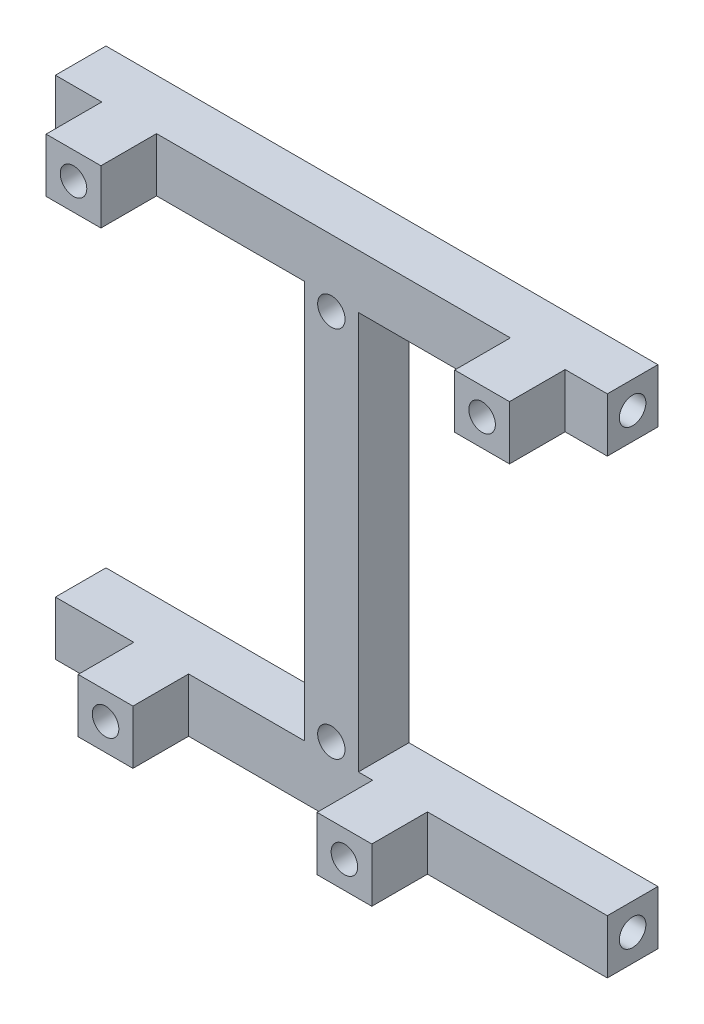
ISO-10303-21;
HEADER;
FILE_DESCRIPTION(('STEP AP214'),'2;1');
FILE_NAME('part.step','',(''),(''),'','','');
FILE_SCHEMA(('AUTOMOTIVE_DESIGN { 1 0 10303 214 1 1 1 1 }'));
ENDSEC;
DATA;
#1=APPLICATION_CONTEXT('core data for automotive mechanical design processes');
#2=APPLICATION_PROTOCOL_DEFINITION('international standard','automotive_design',2000,#1);
#3=PRODUCT_CONTEXT('',#1,'mechanical');
#4=PRODUCT('Part','Part','',(#3));
#5=PRODUCT_RELATED_PRODUCT_CATEGORY('part','',(#4));
#6=PRODUCT_DEFINITION_FORMATION('','',#4);
#7=PRODUCT_DEFINITION_CONTEXT('part definition',#1,'design');
#8=PRODUCT_DEFINITION('design','',#6,#7);
#9=PRODUCT_DEFINITION_SHAPE('','',#8);
#10=(LENGTH_UNIT() NAMED_UNIT(*) SI_UNIT(.MILLI.,.METRE.));
#11=(NAMED_UNIT(*) PLANE_ANGLE_UNIT() SI_UNIT($,.RADIAN.));
#12=(NAMED_UNIT(*) SI_UNIT($,.STERADIAN.) SOLID_ANGLE_UNIT());
#13=UNCERTAINTY_MEASURE_WITH_UNIT(LENGTH_MEASURE(1.E-05),#10,'distance_accuracy_value','');
#14=(GEOMETRIC_REPRESENTATION_CONTEXT(3) GLOBAL_UNCERTAINTY_ASSIGNED_CONTEXT((#13)) GLOBAL_UNIT_ASSIGNED_CONTEXT((#10,
#11,#12)) REPRESENTATION_CONTEXT('',''));
#15=CARTESIAN_POINT('',(0.,0.,0.));
#16=DIRECTION('',(0.,0.,1.));
#17=DIRECTION('',(1.,0.,0.));
#18=AXIS2_PLACEMENT_3D('',#15,#16,#17);
#19=CARTESIAN_POINT('',(0.,0.,6.));
#20=DIRECTION('',(0.,0.,-1.));
#21=DIRECTION('',(-1.,0.,0.));
#22=AXIS2_PLACEMENT_3D('',#19,#20,#21);
#23=PLANE('',#22);
#24=DIRECTION('',(1.,0.,0.));
#25=VECTOR('',#24,1.);
#26=CARTESIAN_POINT('',(-39.73,-30.,6.));
#27=LINE('',#26,#25);
#28=CARTESIAN_POINT('',(11.4,-30.,6.));
#29=VERTEX_POINT('',#28);
#30=CARTESIAN_POINT('',(32.73,-30.,6.));
#31=VERTEX_POINT('',#30);
#32=EDGE_CURVE('E266',#29,#31,#27,.T.);
#33=ORIENTED_EDGE('',*,*,#32,.T.);
#34=DIRECTION('',(0.,-1.,0.));
#35=VECTOR('',#34,1.);
#36=CARTESIAN_POINT('',(32.73,-30.,6.));
#37=LINE('',#36,#35);
#38=CARTESIAN_POINT('',(32.73,-23.6,6.));
#39=VERTEX_POINT('',#38);
#40=EDGE_CURVE('E509',#39,#31,#37,.T.);
#41=ORIENTED_EDGE('',*,*,#40,.F.);
#42=DIRECTION('',(-1.,0.,0.));
#43=VECTOR('',#42,1.);
#44=CARTESIAN_POINT('',(3.20000000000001,-23.6,6.));
#45=LINE('',#44,#43);
#46=CARTESIAN_POINT('',(11.4,-23.6,6.));
#47=VERTEX_POINT('',#46);
#48=EDGE_CURVE('E271',#39,#47,#45,.T.);
#49=ORIENTED_EDGE('',*,*,#48,.T.);
#50=DIRECTION('',(0.,1.,0.));
#51=VECTOR('',#50,1.);
#52=CARTESIAN_POINT('',(11.4,-30.,6.));
#53=LINE('',#52,#51);
#54=EDGE_CURVE('E366',#29,#47,#53,.T.);
#55=ORIENTED_EDGE('',*,*,#54,.F.);
#56=EDGE_LOOP('',(#33,#41,#49,#55));
#57=FACE_BOUND('',#56,.T.);
#58=ADVANCED_FACE('F33',(#57),#23,.F.);
#59=CARTESIAN_POINT('',(0.,22.1,6.));
#60=DIRECTION('',(0.,0.,1.));
#61=DIRECTION('',(1.,0.,0.));
#62=AXIS2_PLACEMENT_3D('',#59,#60,#61);
#63=CIRCLE('',#62,1.625);
#64=CARTESIAN_POINT('',(1.62500000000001,22.1,6.));
#65=VERTEX_POINT('',#64);
#66=EDGE_CURVE('E337',#65,#65,#63,.T.);
#67=ORIENTED_EDGE('',*,*,#66,.F.);
#68=EDGE_LOOP('',(#67));
#69=FACE_BOUND('',#68,.T.);
#70=CARTESIAN_POINT('',(0.,-22.1,6.));
#71=DIRECTION('',(0.,0.,1.));
#72=DIRECTION('',(1.,0.,0.));
#73=AXIS2_PLACEMENT_3D('',#70,#71,#72);
#74=CIRCLE('',#73,1.625);
#75=CARTESIAN_POINT('',(1.62500000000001,-22.1,6.));
#76=VERTEX_POINT('',#75);
#77=EDGE_CURVE('E330',#76,#76,#74,.T.);
#78=ORIENTED_EDGE('',*,*,#77,.F.);
#79=EDGE_LOOP('',(#78));
#80=FACE_BOUND('',#79,.T.);
#81=DIRECTION('',(0.,-1.,0.));
#82=VECTOR('',#81,1.);
#83=CARTESIAN_POINT('',(4.90000000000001,-30.,6.));
#84=LINE('',#83,#82);
#85=CARTESIAN_POINT('',(4.90000000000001,-23.6,6.));
#86=VERTEX_POINT('',#85);
#87=CARTESIAN_POINT('',(4.90000000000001,-30.,6.));
#88=VERTEX_POINT('',#87);
#89=EDGE_CURVE('E373',#86,#88,#84,.T.);
#90=ORIENTED_EDGE('',*,*,#89,.F.);
#91=CARTESIAN_POINT('',(3.20000000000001,-23.6,6.));
#92=VERTEX_POINT('',#91);
#93=EDGE_CURVE('E269',#86,#92,#45,.T.);
#94=ORIENTED_EDGE('',*,*,#93,.T.);
#95=DIRECTION('',(0.,1.,0.));
#96=VECTOR('',#95,1.);
#97=CARTESIAN_POINT('',(3.20000000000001,-23.6,6.));
#98=LINE('',#97,#96);
#99=CARTESIAN_POINT('',(3.20000000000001,23.6,6.));
#100=VERTEX_POINT('',#99);
#101=EDGE_CURVE('E273',#92,#100,#98,.T.);
#102=ORIENTED_EDGE('',*,*,#101,.T.);
#103=DIRECTION('',(1.,0.,0.));
#104=VECTOR('',#103,1.);
#105=CARTESIAN_POINT('',(3.20000000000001,23.6,6.));
#106=LINE('',#105,#104);
#107=CARTESIAN_POINT('',(21.23,23.6,6.));
#108=VERTEX_POINT('',#107);
#109=EDGE_CURVE('E276',#100,#108,#106,.T.);
#110=ORIENTED_EDGE('',*,*,#109,.T.);
#111=DIRECTION('',(0.,-1.,0.));
#112=VECTOR('',#111,1.);
#113=CARTESIAN_POINT('',(21.23,30.,6.));
#114=LINE('',#113,#112);
#115=CARTESIAN_POINT('',(21.23,30.,6.));
#116=VERTEX_POINT('',#115);
#117=EDGE_CURVE('E427',#116,#108,#114,.T.);
#118=ORIENTED_EDGE('',*,*,#117,.F.);
#119=DIRECTION('',(-1.,0.,0.));
#120=VECTOR('',#119,1.);
#121=CARTESIAN_POINT('',(-39.73,30.,6.));
#122=LINE('',#121,#120);
#123=CARTESIAN_POINT('',(-20.73,30.,6.));
#124=VERTEX_POINT('',#123);
#125=EDGE_CURVE('E241',#116,#124,#122,.T.);
#126=ORIENTED_EDGE('',*,*,#125,.T.);
#127=DIRECTION('',(0.,1.,0.));
#128=VECTOR('',#127,1.);
#129=CARTESIAN_POINT('',(-20.73,23.6,6.));
#130=LINE('',#129,#128);
#131=CARTESIAN_POINT('',(-20.73,23.6,6.));
#132=VERTEX_POINT('',#131);
#133=EDGE_CURVE('E448',#132,#124,#130,.T.);
#134=ORIENTED_EDGE('',*,*,#133,.F.);
#135=DIRECTION('',(1.,0.,0.));
#136=VECTOR('',#135,1.);
#137=CARTESIAN_POINT('',(-39.73,23.6,6.));
#138=LINE('',#137,#136);
#139=CARTESIAN_POINT('',(-3.19999999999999,23.6,6.));
#140=VERTEX_POINT('',#139);
#141=EDGE_CURVE('E250',#132,#140,#138,.T.);
#142=ORIENTED_EDGE('',*,*,#141,.T.);
#143=DIRECTION('',(0.,-1.,0.));
#144=VECTOR('',#143,1.);
#145=CARTESIAN_POINT('',(-3.19999999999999,-23.6,6.));
#146=LINE('',#145,#144);
#147=CARTESIAN_POINT('',(-3.19999999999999,-23.6,6.));
#148=VERTEX_POINT('',#147);
#149=EDGE_CURVE('E260',#140,#148,#146,.T.);
#150=ORIENTED_EDGE('',*,*,#149,.T.);
#151=DIRECTION('',(-1.,0.,0.));
#152=VECTOR('',#151,1.);
#153=CARTESIAN_POINT('',(-39.73,-23.6,6.));
#154=LINE('',#153,#152);
#155=CARTESIAN_POINT('',(-16.93,-23.6,6.));
#156=VERTEX_POINT('',#155);
#157=EDGE_CURVE('E264',#148,#156,#154,.T.);
#158=ORIENTED_EDGE('',*,*,#157,.T.);
#159=DIRECTION('',(0.,1.,0.));
#160=VECTOR('',#159,1.);
#161=CARTESIAN_POINT('',(-16.93,-30.,6.));
#162=LINE('',#161,#160);
#163=CARTESIAN_POINT('',(-16.93,-30.,6.));
#164=VERTEX_POINT('',#163);
#165=EDGE_CURVE('E400',#164,#156,#162,.T.);
#166=ORIENTED_EDGE('',*,*,#165,.F.);
#167=EDGE_CURVE('E270',#164,#88,#27,.T.);
#168=ORIENTED_EDGE('',*,*,#167,.T.);
#169=EDGE_LOOP('',(#90,#94,#102,#110,#118,#126,#134,#142,#150,#158,#166,#168));
#170=FACE_BOUND('',#169,.T.);
#171=ADVANCED_FACE('F484',(#69,#80,#170),#23,.F.);
#172=CARTESIAN_POINT('',(-23.43,-23.6,6.));
#173=VERTEX_POINT('',#172);
#174=CARTESIAN_POINT('',(-32.73,-23.6,6.));
#175=VERTEX_POINT('',#174);
#176=EDGE_CURVE('E263',#173,#175,#154,.T.);
#177=ORIENTED_EDGE('',*,*,#176,.T.);
#178=DIRECTION('',(0.,1.,0.));
#179=VECTOR('',#178,1.);
#180=CARTESIAN_POINT('',(-32.73,30.,6.));
#181=LINE('',#180,#179);
#182=CARTESIAN_POINT('',(-32.73,-30.,6.));
#183=VERTEX_POINT('',#182);
#184=EDGE_CURVE('E225',#183,#175,#181,.T.);
#185=ORIENTED_EDGE('',*,*,#184,.F.);
#186=CARTESIAN_POINT('',(-23.43,-30.,6.));
#187=VERTEX_POINT('',#186);
#188=EDGE_CURVE('E267',#183,#187,#27,.T.);
#189=ORIENTED_EDGE('',*,*,#188,.T.);
#190=DIRECTION('',(0.,-1.,0.));
#191=VECTOR('',#190,1.);
#192=CARTESIAN_POINT('',(-23.43,-30.,6.));
#193=LINE('',#192,#191);
#194=EDGE_CURVE('E395',#173,#187,#193,.T.);
#195=ORIENTED_EDGE('',*,*,#194,.F.);
#196=EDGE_LOOP('',(#177,#185,#189,#195));
#197=FACE_BOUND('',#196,.T.);
#198=ADVANCED_FACE('F563',(#197),#23,.F.);
#199=CARTESIAN_POINT('',(27.73,23.6,6.));
#200=VERTEX_POINT('',#199);
#201=CARTESIAN_POINT('',(32.73,23.6,6.));
#202=VERTEX_POINT('',#201);
#203=EDGE_CURVE('E275',#200,#202,#106,.T.);
#204=ORIENTED_EDGE('',*,*,#203,.T.);
#205=CARTESIAN_POINT('',(32.73,30.,6.));
#206=VERTEX_POINT('',#205);
#207=EDGE_CURVE('E573',#206,#202,#37,.T.);
#208=ORIENTED_EDGE('',*,*,#207,.F.);
#209=CARTESIAN_POINT('',(27.73,30.,6.));
#210=VERTEX_POINT('',#209);
#211=EDGE_CURVE('E244',#206,#210,#122,.T.);
#212=ORIENTED_EDGE('',*,*,#211,.T.);
#213=DIRECTION('',(0.,1.,0.));
#214=VECTOR('',#213,1.);
#215=CARTESIAN_POINT('',(27.73,30.,6.));
#216=LINE('',#215,#214);
#217=EDGE_CURVE('E422',#200,#210,#216,.T.);
#218=ORIENTED_EDGE('',*,*,#217,.F.);
#219=EDGE_LOOP('',(#204,#208,#212,#218));
#220=FACE_BOUND('',#219,.T.);
#221=ADVANCED_FACE('F603',(#220),#23,.F.);
#222=CARTESIAN_POINT('',(-27.23,30.,6.));
#223=VERTEX_POINT('',#222);
#224=CARTESIAN_POINT('',(-32.73,30.,6.));
#225=VERTEX_POINT('',#224);
#226=EDGE_CURVE('E231',#223,#225,#122,.T.);
#227=ORIENTED_EDGE('',*,*,#226,.T.);
#228=CARTESIAN_POINT('',(-32.73,23.6,6.));
#229=VERTEX_POINT('',#228);
#230=EDGE_CURVE('E218',#229,#225,#181,.T.);
#231=ORIENTED_EDGE('',*,*,#230,.F.);
#232=CARTESIAN_POINT('',(-27.23,23.6,6.));
#233=VERTEX_POINT('',#232);
#234=EDGE_CURVE('E256',#229,#233,#138,.T.);
#235=ORIENTED_EDGE('',*,*,#234,.T.);
#236=DIRECTION('',(0.,-1.,0.));
#237=VECTOR('',#236,1.);
#238=CARTESIAN_POINT('',(-27.23,23.6,6.));
#239=LINE('',#238,#237);
#240=EDGE_CURVE('E240',#223,#233,#239,.T.);
#241=ORIENTED_EDGE('',*,*,#240,.F.);
#242=EDGE_LOOP('',(#227,#231,#235,#241));
#243=FACE_BOUND('',#242,.T.);
#244=ADVANCED_FACE('F238',(#243),#23,.F.);
#245=CARTESIAN_POINT('',(-39.73,30.,6.));
#246=DIRECTION('',(0.,-1.,0.));
#247=DIRECTION('',(0.,0.,-1.));
#248=AXIS2_PLACEMENT_3D('',#245,#246,#247);
#249=PLANE('',#248);
#250=DIRECTION('',(-1.,0.,0.));
#251=VECTOR('',#250,1.);
#252=CARTESIAN_POINT('',(-39.73,30.,0.));
#253=LINE('',#252,#251);
#254=CARTESIAN_POINT('',(32.73,30.,0.));
#255=VERTEX_POINT('',#254);
#256=CARTESIAN_POINT('',(-32.73,30.,0.));
#257=VERTEX_POINT('',#256);
#258=EDGE_CURVE('E235',#255,#257,#253,.T.);
#259=ORIENTED_EDGE('',*,*,#258,.T.);
#260=DIRECTION('',(0.,0.,-1.));
#261=VECTOR('',#260,1.);
#262=CARTESIAN_POINT('',(-32.73,30.,6.));
#263=LINE('',#262,#261);
#264=EDGE_CURVE('E50',#225,#257,#263,.T.);
#265=ORIENTED_EDGE('',*,*,#264,.F.);
#266=ORIENTED_EDGE('',*,*,#226,.F.);
#267=DIRECTION('',(0.,0.,-1.));
#268=VECTOR('',#267,1.);
#269=CARTESIAN_POINT('',(-27.23,30.,12.6));
#270=LINE('',#269,#268);
#271=CARTESIAN_POINT('',(-27.23,30.,12.6));
#272=VERTEX_POINT('',#271);
#273=EDGE_CURVE('E464',#272,#223,#270,.T.);
#274=ORIENTED_EDGE('',*,*,#273,.F.);
#275=DIRECTION('',(-1.,0.,0.));
#276=VECTOR('',#275,1.);
#277=CARTESIAN_POINT('',(-27.23,30.,12.6));
#278=LINE('',#277,#276);
#279=CARTESIAN_POINT('',(-20.73,30.,12.6));
#280=VERTEX_POINT('',#279);
#281=EDGE_CURVE('E454',#280,#272,#278,.T.);
#282=ORIENTED_EDGE('',*,*,#281,.F.);
#283=DIRECTION('',(0.,0.,-1.));
#284=VECTOR('',#283,1.);
#285=CARTESIAN_POINT('',(-20.73,30.,12.6));
#286=LINE('',#285,#284);
#287=EDGE_CURVE('E466',#280,#124,#286,.T.);
#288=ORIENTED_EDGE('',*,*,#287,.T.);
#289=ORIENTED_EDGE('',*,*,#125,.F.);
#290=DIRECTION('',(0.,0.,-1.));
#291=VECTOR('',#290,1.);
#292=CARTESIAN_POINT('',(21.23,30.,12.6));
#293=LINE('',#292,#291);
#294=CARTESIAN_POINT('',(21.23,30.,12.6));
#295=VERTEX_POINT('',#294);
#296=EDGE_CURVE('E443',#295,#116,#293,.T.);
#297=ORIENTED_EDGE('',*,*,#296,.F.);
#298=DIRECTION('',(-1.,0.,0.));
#299=VECTOR('',#298,1.);
#300=CARTESIAN_POINT('',(27.73,30.,12.6));
#301=LINE('',#300,#299);
#302=CARTESIAN_POINT('',(27.73,30.,12.6));
#303=VERTEX_POINT('',#302);
#304=EDGE_CURVE('E426',#303,#295,#301,.T.);
#305=ORIENTED_EDGE('',*,*,#304,.F.);
#306=DIRECTION('',(0.,0.,-1.));
#307=VECTOR('',#306,1.);
#308=CARTESIAN_POINT('',(27.73,30.,12.6));
#309=LINE('',#308,#307);
#310=EDGE_CURVE('E446',#303,#210,#309,.T.);
#311=ORIENTED_EDGE('',*,*,#310,.T.);
#312=ORIENTED_EDGE('',*,*,#211,.F.);
#313=DIRECTION('',(0.,0.,1.));
#314=VECTOR('',#313,1.);
#315=CARTESIAN_POINT('',(32.73,30.,6.));
#316=LINE('',#315,#314);
#317=EDGE_CURVE('E302',#255,#206,#316,.T.);
#318=ORIENTED_EDGE('',*,*,#317,.F.);
#319=EDGE_LOOP('',(#259,#265,#266,#274,#282,#288,#289,#297,#305,#311,#312,#318));
#320=FACE_BOUND('',#319,.T.);
#321=ADVANCED_FACE('F35',(#320),#249,.F.);
#322=CARTESIAN_POINT('',(-39.73,23.6,6.));
#323=DIRECTION('',(0.,1.,0.));
#324=DIRECTION('',(0.,0.,1.));
#325=AXIS2_PLACEMENT_3D('',#322,#323,#324);
#326=PLANE('',#325);
#327=ORIENTED_EDGE('',*,*,#234,.F.);
#328=DIRECTION('',(0.,0.,-1.));
#329=VECTOR('',#328,1.);
#330=CARTESIAN_POINT('',(-32.73,23.6,6.));
#331=LINE('',#330,#329);
#332=CARTESIAN_POINT('',(-32.73,23.6,0.));
#333=VERTEX_POINT('',#332);
#334=EDGE_CURVE('E221',#229,#333,#331,.T.);
#335=ORIENTED_EDGE('',*,*,#334,.T.);
#336=DIRECTION('',(1.,0.,0.));
#337=VECTOR('',#336,1.);
#338=CARTESIAN_POINT('',(-39.73,23.6,0.));
#339=LINE('',#338,#337);
#340=CARTESIAN_POINT('',(-3.19999999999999,23.6,0.));
#341=VERTEX_POINT('',#340);
#342=EDGE_CURVE('E280',#333,#341,#339,.T.);
#343=ORIENTED_EDGE('',*,*,#342,.T.);
#344=DIRECTION('',(0.,0.,-1.));
#345=VECTOR('',#344,1.);
#346=CARTESIAN_POINT('',(-3.19999999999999,23.6,6.));
#347=LINE('',#346,#345);
#348=EDGE_CURVE('E11',#140,#341,#347,.T.);
#349=ORIENTED_EDGE('',*,*,#348,.F.);
#350=ORIENTED_EDGE('',*,*,#141,.F.);
#351=DIRECTION('',(0.,0.,-1.));
#352=VECTOR('',#351,1.);
#353=CARTESIAN_POINT('',(-20.73,23.6,12.6));
#354=LINE('',#353,#352);
#355=CARTESIAN_POINT('',(-20.73,23.6,12.6));
#356=VERTEX_POINT('',#355);
#357=EDGE_CURVE('E281',#356,#132,#354,.T.);
#358=ORIENTED_EDGE('',*,*,#357,.F.);
#359=DIRECTION('',(1.,0.,0.));
#360=VECTOR('',#359,1.);
#361=CARTESIAN_POINT('',(-20.73,23.6,12.6));
#362=LINE('',#361,#360);
#363=CARTESIAN_POINT('',(-27.23,23.6,12.6));
#364=VERTEX_POINT('',#363);
#365=EDGE_CURVE('E449',#364,#356,#362,.T.);
#366=ORIENTED_EDGE('',*,*,#365,.F.);
#367=DIRECTION('',(0.,0.,-1.));
#368=VECTOR('',#367,1.);
#369=CARTESIAN_POINT('',(-27.23,23.6,12.6));
#370=LINE('',#369,#368);
#371=EDGE_CURVE('E458',#364,#233,#370,.T.);
#372=ORIENTED_EDGE('',*,*,#371,.T.);
#373=EDGE_LOOP('',(#327,#335,#343,#349,#350,#358,#366,#372));
#374=FACE_BOUND('',#373,.T.);
#375=ADVANCED_FACE('F475',(#374),#326,.F.);
#376=CARTESIAN_POINT('',(-3.19999999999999,-23.6,6.));
#377=DIRECTION('',(1.,0.,0.));
#378=DIRECTION('',(0.,0.,-1.));
#379=AXIS2_PLACEMENT_3D('',#376,#377,#378);
#380=PLANE('',#379);
#381=DIRECTION('',(0.,-1.,0.));
#382=VECTOR('',#381,1.);
#383=CARTESIAN_POINT('',(-3.19999999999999,-23.6,0.));
#384=LINE('',#383,#382);
#385=CARTESIAN_POINT('',(-3.19999999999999,-23.6,0.));
#386=VERTEX_POINT('',#385);
#387=EDGE_CURVE('E283',#341,#386,#384,.T.);
#388=ORIENTED_EDGE('',*,*,#387,.T.);
#389=DIRECTION('',(0.,0.,-1.));
#390=VECTOR('',#389,1.);
#391=CARTESIAN_POINT('',(-3.19999999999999,-23.6,6.));
#392=LINE('',#391,#390);
#393=EDGE_CURVE('E42',#148,#386,#392,.T.);
#394=ORIENTED_EDGE('',*,*,#393,.F.);
#395=ORIENTED_EDGE('',*,*,#149,.F.);
#396=ORIENTED_EDGE('',*,*,#348,.T.);
#397=EDGE_LOOP('',(#388,#394,#395,#396));
#398=FACE_BOUND('',#397,.T.);
#399=ADVANCED_FACE('F481',(#398),#380,.F.);
#400=CARTESIAN_POINT('',(-39.73,-23.6,6.));
#401=DIRECTION('',(0.,-1.,0.));
#402=DIRECTION('',(0.,0.,-1.));
#403=AXIS2_PLACEMENT_3D('',#400,#401,#402);
#404=PLANE('',#403);
#405=DIRECTION('',(-1.,0.,0.));
#406=VECTOR('',#405,1.);
#407=CARTESIAN_POINT('',(-39.73,-23.6,0.));
#408=LINE('',#407,#406);
#409=CARTESIAN_POINT('',(-32.73,-23.6,0.));
#410=VERTEX_POINT('',#409);
#411=EDGE_CURVE('E285',#386,#410,#408,.T.);
#412=ORIENTED_EDGE('',*,*,#411,.T.);
#413=DIRECTION('',(0.,0.,1.));
#414=VECTOR('',#413,1.);
#415=CARTESIAN_POINT('',(-32.73,-23.6,6.));
#416=LINE('',#415,#414);
#417=EDGE_CURVE('E58',#410,#175,#416,.T.);
#418=ORIENTED_EDGE('',*,*,#417,.T.);
#419=ORIENTED_EDGE('',*,*,#176,.F.);
#420=DIRECTION('',(0.,0.,-1.));
#421=VECTOR('',#420,1.);
#422=CARTESIAN_POINT('',(-23.43,-23.6,12.6));
#423=LINE('',#422,#421);
#424=CARTESIAN_POINT('',(-23.43,-23.6,12.6));
#425=VERTEX_POINT('',#424);
#426=EDGE_CURVE('E406',#425,#173,#423,.T.);
#427=ORIENTED_EDGE('',*,*,#426,.F.);
#428=DIRECTION('',(-1.,0.,0.));
#429=VECTOR('',#428,1.);
#430=CARTESIAN_POINT('',(-16.93,-23.6,12.6));
#431=LINE('',#430,#429);
#432=CARTESIAN_POINT('',(-16.93,-23.6,12.6));
#433=VERTEX_POINT('',#432);
#434=EDGE_CURVE('E404',#433,#425,#431,.T.);
#435=ORIENTED_EDGE('',*,*,#434,.F.);
#436=DIRECTION('',(0.,0.,-1.));
#437=VECTOR('',#436,1.);
#438=CARTESIAN_POINT('',(-16.93,-23.6,12.6));
#439=LINE('',#438,#437);
#440=EDGE_CURVE('E413',#433,#156,#439,.T.);
#441=ORIENTED_EDGE('',*,*,#440,.T.);
#442=ORIENTED_EDGE('',*,*,#157,.F.);
#443=ORIENTED_EDGE('',*,*,#393,.T.);
#444=EDGE_LOOP('',(#412,#418,#419,#427,#435,#441,#442,#443));
#445=FACE_BOUND('',#444,.T.);
#446=ADVANCED_FACE('F493',(#445),#404,.F.);
#447=CARTESIAN_POINT('',(-39.73,-30.,6.));
#448=DIRECTION('',(0.,1.,0.));
#449=DIRECTION('',(0.,0.,1.));
#450=AXIS2_PLACEMENT_3D('',#447,#448,#449);
#451=PLANE('',#450);
#452=ORIENTED_EDGE('',*,*,#188,.F.);
#453=DIRECTION('',(0.,0.,1.));
#454=VECTOR('',#453,1.);
#455=CARTESIAN_POINT('',(-32.73,-30.,6.));
#456=LINE('',#455,#454);
#457=CARTESIAN_POINT('',(-32.73,-30.,0.));
#458=VERTEX_POINT('',#457);
#459=EDGE_CURVE('E567',#458,#183,#456,.T.);
#460=ORIENTED_EDGE('',*,*,#459,.F.);
#461=DIRECTION('',(1.,0.,0.));
#462=VECTOR('',#461,1.);
#463=CARTESIAN_POINT('',(-39.73,-30.,0.));
#464=LINE('',#463,#462);
#465=CARTESIAN_POINT('',(32.73,-30.,0.));
#466=VERTEX_POINT('',#465);
#467=EDGE_CURVE('E288',#458,#466,#464,.T.);
#468=ORIENTED_EDGE('',*,*,#467,.T.);
#469=DIRECTION('',(0.,0.,-1.));
#470=VECTOR('',#469,1.);
#471=CARTESIAN_POINT('',(32.73,-30.,6.));
#472=LINE('',#471,#470);
#473=EDGE_CURVE('E514',#31,#466,#472,.T.);
#474=ORIENTED_EDGE('',*,*,#473,.F.);
#475=ORIENTED_EDGE('',*,*,#32,.F.);
#476=DIRECTION('',(0.,0.,-1.));
#477=VECTOR('',#476,1.);
#478=CARTESIAN_POINT('',(11.4,-30.,12.6));
#479=LINE('',#478,#477);
#480=CARTESIAN_POINT('',(11.4,-30.,12.6));
#481=VERTEX_POINT('',#480);
#482=EDGE_CURVE('E392',#481,#29,#479,.T.);
#483=ORIENTED_EDGE('',*,*,#482,.F.);
#484=DIRECTION('',(1.,0.,0.));
#485=VECTOR('',#484,1.);
#486=CARTESIAN_POINT('',(11.4,-30.,12.6));
#487=LINE('',#486,#485);
#488=CARTESIAN_POINT('',(4.90000000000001,-30.,12.6));
#489=VERTEX_POINT('',#488);
#490=EDGE_CURVE('E369',#489,#481,#487,.T.);
#491=ORIENTED_EDGE('',*,*,#490,.F.);
#492=DIRECTION('',(0.,0.,-1.));
#493=VECTOR('',#492,1.);
#494=CARTESIAN_POINT('',(4.90000000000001,-30.,12.6));
#495=LINE('',#494,#493);
#496=EDGE_CURVE('E379',#489,#88,#495,.T.);
#497=ORIENTED_EDGE('',*,*,#496,.T.);
#498=ORIENTED_EDGE('',*,*,#167,.F.);
#499=DIRECTION('',(0.,0.,-1.));
#500=VECTOR('',#499,1.);
#501=CARTESIAN_POINT('',(-16.93,-30.,12.6));
#502=LINE('',#501,#500);
#503=CARTESIAN_POINT('',(-16.93,-30.,12.6));
#504=VERTEX_POINT('',#503);
#505=EDGE_CURVE('E416',#504,#164,#502,.T.);
#506=ORIENTED_EDGE('',*,*,#505,.F.);
#507=DIRECTION('',(1.,0.,0.));
#508=VECTOR('',#507,1.);
#509=CARTESIAN_POINT('',(-23.43,-30.,12.6));
#510=LINE('',#509,#508);
#511=CARTESIAN_POINT('',(-23.43,-30.,12.6));
#512=VERTEX_POINT('',#511);
#513=EDGE_CURVE('E399',#512,#504,#510,.T.);
#514=ORIENTED_EDGE('',*,*,#513,.F.);
#515=DIRECTION('',(0.,0.,-1.));
#516=VECTOR('',#515,1.);
#517=CARTESIAN_POINT('',(-23.43,-30.,12.6));
#518=LINE('',#517,#516);
#519=EDGE_CURVE('E419',#512,#187,#518,.T.);
#520=ORIENTED_EDGE('',*,*,#519,.T.);
#521=EDGE_LOOP('',(#452,#460,#468,#474,#475,#483,#491,#497,#498,#506,#514,#520));
#522=FACE_BOUND('',#521,.T.);
#523=ADVANCED_FACE('F502',(#522),#451,.F.);
#524=CARTESIAN_POINT('',(3.20000000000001,-23.6,6.));
#525=DIRECTION('',(0.,-1.,0.));
#526=DIRECTION('',(0.,0.,-1.));
#527=AXIS2_PLACEMENT_3D('',#524,#525,#526);
#528=PLANE('',#527);
#529=ORIENTED_EDGE('',*,*,#48,.F.);
#530=DIRECTION('',(0.,0.,-1.));
#531=VECTOR('',#530,1.);
#532=CARTESIAN_POINT('',(32.73,-23.6,6.));
#533=LINE('',#532,#531);
#534=CARTESIAN_POINT('',(32.73,-23.6,0.));
#535=VERTEX_POINT('',#534);
#536=EDGE_CURVE('E317',#39,#535,#533,.T.);
#537=ORIENTED_EDGE('',*,*,#536,.T.);
#538=DIRECTION('',(-1.,0.,0.));
#539=VECTOR('',#538,1.);
#540=CARTESIAN_POINT('',(3.20000000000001,-23.6,0.));
#541=LINE('',#540,#539);
#542=CARTESIAN_POINT('',(3.20000000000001,-23.6,0.));
#543=VERTEX_POINT('',#542);
#544=EDGE_CURVE('E290',#535,#543,#541,.T.);
#545=ORIENTED_EDGE('',*,*,#544,.T.);
#546=DIRECTION('',(0.,0.,-1.));
#547=VECTOR('',#546,1.);
#548=CARTESIAN_POINT('',(3.20000000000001,-23.6,6.));
#549=LINE('',#548,#547);
#550=EDGE_CURVE('E295',#92,#543,#549,.T.);
#551=ORIENTED_EDGE('',*,*,#550,.F.);
#552=ORIENTED_EDGE('',*,*,#93,.F.);
#553=DIRECTION('',(0.,0.,-1.));
#554=VECTOR('',#553,1.);
#555=CARTESIAN_POINT('',(4.90000000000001,-23.6,12.6));
#556=LINE('',#555,#554);
#557=CARTESIAN_POINT('',(4.90000000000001,-23.6,12.6));
#558=VERTEX_POINT('',#557);
#559=EDGE_CURVE('E386',#558,#86,#556,.T.);
#560=ORIENTED_EDGE('',*,*,#559,.F.);
#561=DIRECTION('',(-1.,0.,0.));
#562=VECTOR('',#561,1.);
#563=CARTESIAN_POINT('',(4.90000000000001,-23.6,12.6));
#564=LINE('',#563,#562);
#565=CARTESIAN_POINT('',(11.4,-23.6,12.6));
#566=VERTEX_POINT('',#565);
#567=EDGE_CURVE('E375',#566,#558,#564,.T.);
#568=ORIENTED_EDGE('',*,*,#567,.F.);
#569=DIRECTION('',(0.,0.,-1.));
#570=VECTOR('',#569,1.);
#571=CARTESIAN_POINT('',(11.4,-23.6,12.6));
#572=LINE('',#571,#570);
#573=EDGE_CURVE('E389',#566,#47,#572,.T.);
#574=ORIENTED_EDGE('',*,*,#573,.T.);
#575=EDGE_LOOP('',(#529,#537,#545,#551,#552,#560,#568,#574));
#576=FACE_BOUND('',#575,.T.);
#577=ADVANCED_FACE('F529',(#576),#528,.F.);
#578=CARTESIAN_POINT('',(3.20000000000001,-23.6,6.));
#579=DIRECTION('',(-1.,0.,0.));
#580=DIRECTION('',(0.,0.,1.));
#581=AXIS2_PLACEMENT_3D('',#578,#579,#580);
#582=PLANE('',#581);
#583=DIRECTION('',(0.,1.,0.));
#584=VECTOR('',#583,1.);
#585=CARTESIAN_POINT('',(3.20000000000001,-23.6,0.));
#586=LINE('',#585,#584);
#587=CARTESIAN_POINT('',(3.20000000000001,23.6,0.));
#588=VERTEX_POINT('',#587);
#589=EDGE_CURVE('E246',#543,#588,#586,.T.);
#590=ORIENTED_EDGE('',*,*,#589,.T.);
#591=DIRECTION('',(0.,0.,-1.));
#592=VECTOR('',#591,1.);
#593=CARTESIAN_POINT('',(3.20000000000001,23.6,6.));
#594=LINE('',#593,#592);
#595=EDGE_CURVE('E278',#100,#588,#594,.T.);
#596=ORIENTED_EDGE('',*,*,#595,.F.);
#597=ORIENTED_EDGE('',*,*,#101,.F.);
#598=ORIENTED_EDGE('',*,*,#550,.T.);
#599=EDGE_LOOP('',(#590,#596,#597,#598));
#600=FACE_BOUND('',#599,.T.);
#601=ADVANCED_FACE('F533',(#600),#582,.F.);
#602=CARTESIAN_POINT('',(3.20000000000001,23.6,6.));
#603=DIRECTION('',(0.,1.,0.));
#604=DIRECTION('',(0.,0.,1.));
#605=AXIS2_PLACEMENT_3D('',#602,#603,#604);
#606=PLANE('',#605);
#607=DIRECTION('',(1.,0.,0.));
#608=VECTOR('',#607,1.);
#609=CARTESIAN_POINT('',(3.20000000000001,23.6,0.));
#610=LINE('',#609,#608);
#611=CARTESIAN_POINT('',(32.73,23.6,0.));
#612=VERTEX_POINT('',#611);
#613=EDGE_CURVE('E242',#588,#612,#610,.T.);
#614=ORIENTED_EDGE('',*,*,#613,.T.);
#615=DIRECTION('',(0.,0.,1.));
#616=VECTOR('',#615,1.);
#617=CARTESIAN_POINT('',(32.73,23.6,6.));
#618=LINE('',#617,#616);
#619=EDGE_CURVE('E306',#612,#202,#618,.T.);
#620=ORIENTED_EDGE('',*,*,#619,.T.);
#621=ORIENTED_EDGE('',*,*,#203,.F.);
#622=DIRECTION('',(0.,0.,-1.));
#623=VECTOR('',#622,1.);
#624=CARTESIAN_POINT('',(27.73,23.6,12.6));
#625=LINE('',#624,#623);
#626=CARTESIAN_POINT('',(27.73,23.6,12.6));
#627=VERTEX_POINT('',#626);
#628=EDGE_CURVE('E433',#627,#200,#625,.T.);
#629=ORIENTED_EDGE('',*,*,#628,.F.);
#630=DIRECTION('',(1.,0.,0.));
#631=VECTOR('',#630,1.);
#632=CARTESIAN_POINT('',(21.23,23.6,12.6));
#633=LINE('',#632,#631);
#634=CARTESIAN_POINT('',(21.23,23.6,12.6));
#635=VERTEX_POINT('',#634);
#636=EDGE_CURVE('E431',#635,#627,#633,.T.);
#637=ORIENTED_EDGE('',*,*,#636,.F.);
#638=DIRECTION('',(0.,0.,-1.));
#639=VECTOR('',#638,1.);
#640=CARTESIAN_POINT('',(21.23,23.6,12.6));
#641=LINE('',#640,#639);
#642=EDGE_CURVE('E440',#635,#108,#641,.T.);
#643=ORIENTED_EDGE('',*,*,#642,.T.);
#644=ORIENTED_EDGE('',*,*,#109,.F.);
#645=ORIENTED_EDGE('',*,*,#595,.T.);
#646=EDGE_LOOP('',(#614,#620,#621,#629,#637,#643,#644,#645));
#647=FACE_BOUND('',#646,.T.);
#648=ADVANCED_FACE('F537',(#647),#606,.F.);
#649=CARTESIAN_POINT('',(0.,0.,0.));
#650=DIRECTION('',(0.,0.,-1.));
#651=DIRECTION('',(-1.,0.,0.));
#652=AXIS2_PLACEMENT_3D('',#649,#650,#651);
#653=PLANE('',#652);
#654=DIRECTION('',(0.,-1.,0.));
#655=VECTOR('',#654,1.);
#656=CARTESIAN_POINT('',(-32.73,30.,0.));
#657=LINE('',#656,#655);
#658=EDGE_CURVE('E556',#257,#333,#657,.T.);
#659=ORIENTED_EDGE('',*,*,#658,.F.);
#660=ORIENTED_EDGE('',*,*,#258,.F.);
#661=DIRECTION('',(0.,1.,0.));
#662=VECTOR('',#661,1.);
#663=CARTESIAN_POINT('',(32.73,-30.,0.));
#664=LINE('',#663,#662);
#665=EDGE_CURVE('E311',#612,#255,#664,.T.);
#666=ORIENTED_EDGE('',*,*,#665,.F.);
#667=ORIENTED_EDGE('',*,*,#613,.F.);
#668=ORIENTED_EDGE('',*,*,#589,.F.);
#669=ORIENTED_EDGE('',*,*,#544,.F.);
#670=EDGE_CURVE('E308',#466,#535,#664,.T.);
#671=ORIENTED_EDGE('',*,*,#670,.F.);
#672=ORIENTED_EDGE('',*,*,#467,.F.);
#673=EDGE_CURVE('E236',#410,#458,#657,.T.);
#674=ORIENTED_EDGE('',*,*,#673,.F.);
#675=ORIENTED_EDGE('',*,*,#411,.F.);
#676=ORIENTED_EDGE('',*,*,#387,.F.);
#677=ORIENTED_EDGE('',*,*,#342,.F.);
#678=EDGE_LOOP('',(#659,#660,#666,#667,#668,#669,#671,#672,#674,#675,#676,#677));
#679=FACE_BOUND('',#678,.T.);
#680=CARTESIAN_POINT('',(0.,22.1,0.));
#681=DIRECTION('',(0.,0.,1.));
#682=DIRECTION('',(1.,0.,0.));
#683=AXIS2_PLACEMENT_3D('',#680,#681,#682);
#684=CIRCLE('',#683,1.625);
#685=CARTESIAN_POINT('',(1.62500000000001,22.1,0.));
#686=VERTEX_POINT('',#685);
#687=EDGE_CURVE('E333',#686,#686,#684,.T.);
#688=ORIENTED_EDGE('',*,*,#687,.T.);
#689=EDGE_LOOP('',(#688));
#690=FACE_BOUND('',#689,.T.);
#691=CARTESIAN_POINT('',(0.,-22.1,0.));
#692=DIRECTION('',(0.,0.,1.));
#693=DIRECTION('',(1.,0.,0.));
#694=AXIS2_PLACEMENT_3D('',#691,#692,#693);
#695=CIRCLE('',#694,1.625);
#696=CARTESIAN_POINT('',(1.62500000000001,-22.1,0.));
#697=VERTEX_POINT('',#696);
#698=EDGE_CURVE('E340',#697,#697,#695,.T.);
#699=ORIENTED_EDGE('',*,*,#698,.T.);
#700=EDGE_LOOP('',(#699));
#701=FACE_BOUND('',#700,.T.);
#702=ADVANCED_FACE('F554',(#679,#690,#701),#653,.T.);
#703=CARTESIAN_POINT('',(-20.73,23.6,12.6));
#704=DIRECTION('',(-1.,0.,0.));
#705=DIRECTION('',(0.,0.,1.));
#706=AXIS2_PLACEMENT_3D('',#703,#704,#705);
#707=PLANE('',#706);
#708=ORIENTED_EDGE('',*,*,#133,.T.);
#709=ORIENTED_EDGE('',*,*,#287,.F.);
#710=DIRECTION('',(0.,1.,0.));
#711=VECTOR('',#710,1.);
#712=CARTESIAN_POINT('',(-20.73,23.6,12.6));
#713=LINE('',#712,#711);
#714=EDGE_CURVE('E452',#356,#280,#713,.T.);
#715=ORIENTED_EDGE('',*,*,#714,.F.);
#716=ORIENTED_EDGE('',*,*,#357,.T.);
#717=EDGE_LOOP('',(#708,#709,#715,#716));
#718=FACE_BOUND('',#717,.T.);
#719=ADVANCED_FACE('F471',(#718),#707,.F.);
#720=CARTESIAN_POINT('',(-27.23,23.6,12.6));
#721=DIRECTION('',(1.,0.,0.));
#722=DIRECTION('',(0.,0.,-1.));
#723=AXIS2_PLACEMENT_3D('',#720,#721,#722);
#724=PLANE('',#723);
#725=ORIENTED_EDGE('',*,*,#240,.T.);
#726=ORIENTED_EDGE('',*,*,#371,.F.);
#727=DIRECTION('',(0.,-1.,0.));
#728=VECTOR('',#727,1.);
#729=CARTESIAN_POINT('',(-27.23,23.6,12.6));
#730=LINE('',#729,#728);
#731=EDGE_CURVE('E456',#272,#364,#730,.T.);
#732=ORIENTED_EDGE('',*,*,#731,.F.);
#733=ORIENTED_EDGE('',*,*,#273,.T.);
#734=EDGE_LOOP('',(#725,#726,#732,#733));
#735=FACE_BOUND('',#734,.T.);
#736=ADVANCED_FACE('F551',(#735),#724,.F.);
#737=CARTESIAN_POINT('',(0.,0.,12.6));
#738=DIRECTION('',(0.,0.,-1.));
#739=DIRECTION('',(-1.,0.,0.));
#740=AXIS2_PLACEMENT_3D('',#737,#738,#739);
#741=PLANE('',#740);
#742=CARTESIAN_POINT('',(-23.98,26.8,12.6));
#743=DIRECTION('',(0.,0.,1.));
#744=DIRECTION('',(1.,0.,0.));
#745=AXIS2_PLACEMENT_3D('',#742,#743,#744);
#746=CIRCLE('',#745,1.575);
#747=CARTESIAN_POINT('',(-22.405,26.8,12.6));
#748=VERTEX_POINT('',#747);
#749=EDGE_CURVE('E355',#748,#748,#746,.T.);
#750=ORIENTED_EDGE('',*,*,#749,.F.);
#751=EDGE_LOOP('',(#750));
#752=FACE_BOUND('',#751,.T.);
#753=ORIENTED_EDGE('',*,*,#365,.T.);
#754=ORIENTED_EDGE('',*,*,#714,.T.);
#755=ORIENTED_EDGE('',*,*,#281,.T.);
#756=ORIENTED_EDGE('',*,*,#731,.T.);
#757=EDGE_LOOP('',(#753,#754,#755,#756));
#758=FACE_BOUND('',#757,.T.);
#759=ADVANCED_FACE('F548',(#752,#758),#741,.F.);
#760=CARTESIAN_POINT('',(27.73,30.,12.6));
#761=DIRECTION('',(-1.,0.,0.));
#762=DIRECTION('',(0.,0.,1.));
#763=AXIS2_PLACEMENT_3D('',#760,#761,#762);
#764=PLANE('',#763);
#765=ORIENTED_EDGE('',*,*,#217,.T.);
#766=ORIENTED_EDGE('',*,*,#310,.F.);
#767=DIRECTION('',(0.,1.,0.));
#768=VECTOR('',#767,1.);
#769=CARTESIAN_POINT('',(27.73,30.,12.6));
#770=LINE('',#769,#768);
#771=EDGE_CURVE('E423',#627,#303,#770,.T.);
#772=ORIENTED_EDGE('',*,*,#771,.F.);
#773=ORIENTED_EDGE('',*,*,#628,.T.);
#774=EDGE_LOOP('',(#765,#766,#772,#773));
#775=FACE_BOUND('',#774,.T.);
#776=ADVANCED_FACE('F618',(#775),#764,.F.);
#777=CARTESIAN_POINT('',(21.23,30.,12.6));
#778=DIRECTION('',(1.,0.,0.));
#779=DIRECTION('',(0.,0.,-1.));
#780=AXIS2_PLACEMENT_3D('',#777,#778,#779);
#781=PLANE('',#780);
#782=ORIENTED_EDGE('',*,*,#117,.T.);
#783=ORIENTED_EDGE('',*,*,#642,.F.);
#784=DIRECTION('',(0.,-1.,0.));
#785=VECTOR('',#784,1.);
#786=CARTESIAN_POINT('',(21.23,30.,12.6));
#787=LINE('',#786,#785);
#788=EDGE_CURVE('E429',#295,#635,#787,.T.);
#789=ORIENTED_EDGE('',*,*,#788,.F.);
#790=ORIENTED_EDGE('',*,*,#296,.T.);
#791=EDGE_LOOP('',(#782,#783,#789,#790));
#792=FACE_BOUND('',#791,.T.);
#793=ADVANCED_FACE('F542',(#792),#781,.F.);
#794=CARTESIAN_POINT('',(0.,0.,12.6));
#795=DIRECTION('',(0.,0.,1.));
#796=DIRECTION('',(1.,0.,0.));
#797=AXIS2_PLACEMENT_3D('',#794,#795,#796);
#798=PLANE('',#797);
#799=CARTESIAN_POINT('',(24.48,26.8,12.6));
#800=DIRECTION('',(0.,0.,1.));
#801=DIRECTION('',(1.,0.,0.));
#802=AXIS2_PLACEMENT_3D('',#799,#800,#801);
#803=CIRCLE('',#802,1.575);
#804=CARTESIAN_POINT('',(26.055,26.8,12.6));
#805=VERTEX_POINT('',#804);
#806=EDGE_CURVE('E336',#805,#805,#803,.T.);
#807=ORIENTED_EDGE('',*,*,#806,.F.);
#808=EDGE_LOOP('',(#807));
#809=FACE_BOUND('',#808,.T.);
#810=ORIENTED_EDGE('',*,*,#771,.T.);
#811=ORIENTED_EDGE('',*,*,#304,.T.);
#812=ORIENTED_EDGE('',*,*,#788,.T.);
#813=ORIENTED_EDGE('',*,*,#636,.T.);
#814=EDGE_LOOP('',(#810,#811,#812,#813));
#815=FACE_BOUND('',#814,.T.);
#816=ADVANCED_FACE('F620',(#809,#815),#798,.T.);
#817=CARTESIAN_POINT('',(-23.43,-30.,12.6));
#818=DIRECTION('',(1.,0.,0.));
#819=DIRECTION('',(0.,0.,-1.));
#820=AXIS2_PLACEMENT_3D('',#817,#818,#819);
#821=PLANE('',#820);
#822=ORIENTED_EDGE('',*,*,#194,.T.);
#823=ORIENTED_EDGE('',*,*,#519,.F.);
#824=DIRECTION('',(0.,-1.,0.));
#825=VECTOR('',#824,1.);
#826=CARTESIAN_POINT('',(-23.43,-30.,12.6));
#827=LINE('',#826,#825);
#828=EDGE_CURVE('E396',#425,#512,#827,.T.);
#829=ORIENTED_EDGE('',*,*,#828,.F.);
#830=ORIENTED_EDGE('',*,*,#426,.T.);
#831=EDGE_LOOP('',(#822,#823,#829,#830));
#832=FACE_BOUND('',#831,.T.);
#833=ADVANCED_FACE('F565',(#832),#821,.F.);
#834=CARTESIAN_POINT('',(-16.93,-30.,12.6));
#835=DIRECTION('',(-1.,0.,0.));
#836=DIRECTION('',(0.,0.,1.));
#837=AXIS2_PLACEMENT_3D('',#834,#835,#836);
#838=PLANE('',#837);
#839=ORIENTED_EDGE('',*,*,#165,.T.);
#840=ORIENTED_EDGE('',*,*,#440,.F.);
#841=DIRECTION('',(0.,1.,0.));
#842=VECTOR('',#841,1.);
#843=CARTESIAN_POINT('',(-16.93,-30.,12.6));
#844=LINE('',#843,#842);
#845=EDGE_CURVE('E402',#504,#433,#844,.T.);
#846=ORIENTED_EDGE('',*,*,#845,.F.);
#847=ORIENTED_EDGE('',*,*,#505,.T.);
#848=EDGE_LOOP('',(#839,#840,#846,#847));
#849=FACE_BOUND('',#848,.T.);
#850=ADVANCED_FACE('F489',(#849),#838,.F.);
#851=CARTESIAN_POINT('',(0.,0.,12.6));
#852=DIRECTION('',(0.,0.,1.));
#853=DIRECTION('',(1.,0.,0.));
#854=AXIS2_PLACEMENT_3D('',#851,#852,#853);
#855=PLANE('',#854);
#856=CARTESIAN_POINT('',(-20.18,-26.8,12.6));
#857=DIRECTION('',(0.,0.,1.));
#858=DIRECTION('',(1.,0.,0.));
#859=AXIS2_PLACEMENT_3D('',#856,#857,#858);
#860=CIRCLE('',#859,1.575);
#861=CARTESIAN_POINT('',(-18.605,-26.8,12.6));
#862=VERTEX_POINT('',#861);
#863=EDGE_CURVE('E348',#862,#862,#860,.T.);
#864=ORIENTED_EDGE('',*,*,#863,.F.);
#865=EDGE_LOOP('',(#864));
#866=FACE_BOUND('',#865,.T.);
#867=ORIENTED_EDGE('',*,*,#828,.T.);
#868=ORIENTED_EDGE('',*,*,#513,.T.);
#869=ORIENTED_EDGE('',*,*,#845,.T.);
#870=ORIENTED_EDGE('',*,*,#434,.T.);
#871=EDGE_LOOP('',(#867,#868,#869,#870));
#872=FACE_BOUND('',#871,.T.);
#873=ADVANCED_FACE('F498',(#866,#872),#855,.T.);
#874=CARTESIAN_POINT('',(11.4,-30.,12.6));
#875=DIRECTION('',(-1.,0.,0.));
#876=DIRECTION('',(0.,0.,1.));
#877=AXIS2_PLACEMENT_3D('',#874,#875,#876);
#878=PLANE('',#877);
#879=ORIENTED_EDGE('',*,*,#54,.T.);
#880=ORIENTED_EDGE('',*,*,#573,.F.);
#881=DIRECTION('',(0.,1.,0.));
#882=VECTOR('',#881,1.);
#883=CARTESIAN_POINT('',(11.4,-30.,12.6));
#884=LINE('',#883,#882);
#885=EDGE_CURVE('E372',#481,#566,#884,.T.);
#886=ORIENTED_EDGE('',*,*,#885,.F.);
#887=ORIENTED_EDGE('',*,*,#482,.T.);
#888=EDGE_LOOP('',(#879,#880,#886,#887));
#889=FACE_BOUND('',#888,.T.);
#890=ADVANCED_FACE('F516',(#889),#878,.F.);
#891=CARTESIAN_POINT('',(4.90000000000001,-30.,12.6));
#892=DIRECTION('',(1.,0.,0.));
#893=DIRECTION('',(0.,0.,-1.));
#894=AXIS2_PLACEMENT_3D('',#891,#892,#893);
#895=PLANE('',#894);
#896=ORIENTED_EDGE('',*,*,#89,.T.);
#897=ORIENTED_EDGE('',*,*,#496,.F.);
#898=DIRECTION('',(0.,-1.,0.));
#899=VECTOR('',#898,1.);
#900=CARTESIAN_POINT('',(4.90000000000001,-30.,12.6));
#901=LINE('',#900,#899);
#902=EDGE_CURVE('E377',#558,#489,#901,.T.);
#903=ORIENTED_EDGE('',*,*,#902,.F.);
#904=ORIENTED_EDGE('',*,*,#559,.T.);
#905=EDGE_LOOP('',(#896,#897,#903,#904));
#906=FACE_BOUND('',#905,.T.);
#907=ADVANCED_FACE('F524',(#906),#895,.F.);
#908=CARTESIAN_POINT('',(0.,0.,12.6));
#909=DIRECTION('',(0.,0.,-1.));
#910=DIRECTION('',(-1.,0.,0.));
#911=AXIS2_PLACEMENT_3D('',#908,#909,#910);
#912=PLANE('',#911);
#913=CARTESIAN_POINT('',(8.15000000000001,-26.8,12.6));
#914=DIRECTION('',(0.,0.,1.));
#915=DIRECTION('',(1.,0.,0.));
#916=AXIS2_PLACEMENT_3D('',#913,#914,#915);
#917=CIRCLE('',#916,1.575);
#918=CARTESIAN_POINT('',(9.72500000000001,-26.8,12.6));
#919=VERTEX_POINT('',#918);
#920=EDGE_CURVE('E349',#919,#919,#917,.T.);
#921=ORIENTED_EDGE('',*,*,#920,.F.);
#922=EDGE_LOOP('',(#921));
#923=FACE_BOUND('',#922,.T.);
#924=ORIENTED_EDGE('',*,*,#490,.T.);
#925=ORIENTED_EDGE('',*,*,#885,.T.);
#926=ORIENTED_EDGE('',*,*,#567,.T.);
#927=ORIENTED_EDGE('',*,*,#902,.T.);
#928=EDGE_LOOP('',(#924,#925,#926,#927));
#929=FACE_BOUND('',#928,.T.);
#930=ADVANCED_FACE('F520',(#923,#929),#912,.F.);
#931=CARTESIAN_POINT('',(8.15000000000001,-26.8,7.6));
#932=DIRECTION('',(0.,0.,1.));
#933=DIRECTION('',(1.,0.,0.));
#934=AXIS2_PLACEMENT_3D('',#931,#932,#933);
#935=CYLINDRICAL_SURFACE('',#934,1.575);
#936=CARTESIAN_POINT('',(8.15000000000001,-26.8,7.6));
#937=DIRECTION('',(0.,0.,1.));
#938=DIRECTION('',(1.,0.,0.));
#939=AXIS2_PLACEMENT_3D('',#936,#937,#938);
#940=CIRCLE('',#939,1.575);
#941=CARTESIAN_POINT('',(9.72500000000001,-26.8,7.6));
#942=VERTEX_POINT('',#941);
#943=EDGE_CURVE('E345',#942,#942,#940,.T.);
#944=ORIENTED_EDGE('',*,*,#943,.F.);
#945=EDGE_LOOP('',(#944));
#946=FACE_BOUND('',#945,.T.);
#947=ORIENTED_EDGE('',*,*,#920,.T.);
#948=EDGE_LOOP('',(#947));
#949=FACE_BOUND('',#948,.T.);
#950=ADVANCED_FACE('F888',(#946,#949),#935,.F.);
#951=CARTESIAN_POINT('',(0.,0.,7.6));
#952=DIRECTION('',(0.,0.,1.));
#953=DIRECTION('',(1.,0.,0.));
#954=AXIS2_PLACEMENT_3D('',#951,#952,#953);
#955=PLANE('',#954);
#956=ORIENTED_EDGE('',*,*,#943,.T.);
#957=EDGE_LOOP('',(#956));
#958=FACE_BOUND('',#957,.T.);
#959=ADVANCED_FACE('F884',(#958),#955,.T.);
#960=CARTESIAN_POINT('',(-20.18,-26.8,7.6));
#961=DIRECTION('',(0.,0.,1.));
#962=DIRECTION('',(1.,0.,0.));
#963=AXIS2_PLACEMENT_3D('',#960,#961,#962);
#964=CYLINDRICAL_SURFACE('',#963,1.575);
#965=CARTESIAN_POINT('',(-20.18,-26.8,7.6));
#966=DIRECTION('',(0.,0.,1.));
#967=DIRECTION('',(1.,0.,0.));
#968=AXIS2_PLACEMENT_3D('',#965,#966,#967);
#969=CIRCLE('',#968,1.575);
#970=CARTESIAN_POINT('',(-18.605,-26.8,7.6));
#971=VERTEX_POINT('',#970);
#972=EDGE_CURVE('E363',#971,#971,#969,.T.);
#973=ORIENTED_EDGE('',*,*,#972,.F.);
#974=EDGE_LOOP('',(#973));
#975=FACE_BOUND('',#974,.T.);
#976=ORIENTED_EDGE('',*,*,#863,.T.);
#977=EDGE_LOOP('',(#976));
#978=FACE_BOUND('',#977,.T.);
#979=ADVANCED_FACE('F887',(#975,#978),#964,.F.);
#980=CARTESIAN_POINT('',(0.,0.,7.6));
#981=DIRECTION('',(0.,0.,1.));
#982=DIRECTION('',(1.,0.,0.));
#983=AXIS2_PLACEMENT_3D('',#980,#981,#982);
#984=PLANE('',#983);
#985=ORIENTED_EDGE('',*,*,#972,.T.);
#986=EDGE_LOOP('',(#985));
#987=FACE_BOUND('',#986,.T.);
#988=ADVANCED_FACE('F906',(#987),#984,.T.);
#989=CARTESIAN_POINT('',(24.48,26.8,7.6));
#990=DIRECTION('',(0.,0.,1.));
#991=DIRECTION('',(1.,0.,0.));
#992=AXIS2_PLACEMENT_3D('',#989,#990,#991);
#993=CYLINDRICAL_SURFACE('',#992,1.575);
#994=CARTESIAN_POINT('',(24.48,26.8,7.6));
#995=DIRECTION('',(0.,0.,1.));
#996=DIRECTION('',(1.,0.,0.));
#997=AXIS2_PLACEMENT_3D('',#994,#995,#996);
#998=CIRCLE('',#997,1.575);
#999=CARTESIAN_POINT('',(26.055,26.8,7.6));
#1000=VERTEX_POINT('',#999);
#1001=EDGE_CURVE('E358',#1000,#1000,#998,.T.);
#1002=ORIENTED_EDGE('',*,*,#1001,.F.);
#1003=EDGE_LOOP('',(#1002));
#1004=FACE_BOUND('',#1003,.T.);
#1005=ORIENTED_EDGE('',*,*,#806,.T.);
#1006=EDGE_LOOP('',(#1005));
#1007=FACE_BOUND('',#1006,.T.);
#1008=ADVANCED_FACE('F902',(#1004,#1007),#993,.F.);
#1009=CARTESIAN_POINT('',(0.,0.,7.6));
#1010=DIRECTION('',(0.,0.,1.));
#1011=DIRECTION('',(1.,0.,0.));
#1012=AXIS2_PLACEMENT_3D('',#1009,#1010,#1011);
#1013=PLANE('',#1012);
#1014=ORIENTED_EDGE('',*,*,#1001,.T.);
#1015=EDGE_LOOP('',(#1014));
#1016=FACE_BOUND('',#1015,.T.);
#1017=ADVANCED_FACE('F898',(#1016),#1013,.T.);
#1018=CARTESIAN_POINT('',(-23.98,26.8,7.6));
#1019=DIRECTION('',(0.,0.,1.));
#1020=DIRECTION('',(1.,0.,0.));
#1021=AXIS2_PLACEMENT_3D('',#1018,#1019,#1020);
#1022=CYLINDRICAL_SURFACE('',#1021,1.575);
#1023=CARTESIAN_POINT('',(-23.98,26.8,7.6));
#1024=DIRECTION('',(0.,0.,1.));
#1025=DIRECTION('',(1.,0.,0.));
#1026=AXIS2_PLACEMENT_3D('',#1023,#1024,#1025);
#1027=CIRCLE('',#1026,1.575);
#1028=CARTESIAN_POINT('',(-22.405,26.8,7.6));
#1029=VERTEX_POINT('',#1028);
#1030=EDGE_CURVE('E352',#1029,#1029,#1027,.T.);
#1031=ORIENTED_EDGE('',*,*,#1030,.F.);
#1032=EDGE_LOOP('',(#1031));
#1033=FACE_BOUND('',#1032,.T.);
#1034=ORIENTED_EDGE('',*,*,#749,.T.);
#1035=EDGE_LOOP('',(#1034));
#1036=FACE_BOUND('',#1035,.T.);
#1037=ADVANCED_FACE('F894',(#1033,#1036),#1022,.F.);
#1038=CARTESIAN_POINT('',(0.,0.,7.6));
#1039=DIRECTION('',(0.,0.,1.));
#1040=DIRECTION('',(1.,0.,0.));
#1041=AXIS2_PLACEMENT_3D('',#1038,#1039,#1040);
#1042=PLANE('',#1041);
#1043=ORIENTED_EDGE('',*,*,#1030,.T.);
#1044=EDGE_LOOP('',(#1043));
#1045=FACE_BOUND('',#1044,.T.);
#1046=ADVANCED_FACE('F852',(#1045),#1042,.T.);
#1047=CARTESIAN_POINT('',(0.,-22.1,0.));
#1048=DIRECTION('',(0.,0.,1.));
#1049=DIRECTION('',(1.,0.,0.));
#1050=AXIS2_PLACEMENT_3D('',#1047,#1048,#1049);
#1051=CYLINDRICAL_SURFACE('',#1050,1.625);
#1052=ORIENTED_EDGE('',*,*,#698,.F.);
#1053=EDGE_LOOP('',(#1052));
#1054=FACE_BOUND('',#1053,.T.);
#1055=ORIENTED_EDGE('',*,*,#77,.T.);
#1056=EDGE_LOOP('',(#1055));
#1057=FACE_BOUND('',#1056,.T.);
#1058=ADVANCED_FACE('F857',(#1054,#1057),#1051,.F.);
#1059=CARTESIAN_POINT('',(0.,22.1,0.));
#1060=DIRECTION('',(0.,0.,1.));
#1061=DIRECTION('',(1.,0.,0.));
#1062=AXIS2_PLACEMENT_3D('',#1059,#1060,#1061);
#1063=CYLINDRICAL_SURFACE('',#1062,1.625);
#1064=ORIENTED_EDGE('',*,*,#687,.F.);
#1065=EDGE_LOOP('',(#1064));
#1066=FACE_BOUND('',#1065,.T.);
#1067=ORIENTED_EDGE('',*,*,#66,.T.);
#1068=EDGE_LOOP('',(#1067));
#1069=FACE_BOUND('',#1068,.T.);
#1070=ADVANCED_FACE('F697',(#1066,#1069),#1063,.F.);
#1071=CARTESIAN_POINT('',(32.73,0.,0.));
#1072=DIRECTION('',(-1.,0.,0.));
#1073=DIRECTION('',(0.,0.,1.));
#1074=AXIS2_PLACEMENT_3D('',#1071,#1072,#1073);
#1075=PLANE('',#1074);
#1076=CARTESIAN_POINT('',(32.73,26.8,3.));
#1077=DIRECTION('',(-1.,0.,0.));
#1078=DIRECTION('',(0.,0.,1.));
#1079=AXIS2_PLACEMENT_3D('',#1076,#1077,#1078);
#1080=CIRCLE('',#1079,1.575);
#1081=CARTESIAN_POINT('',(32.73,26.8,4.575));
#1082=VERTEX_POINT('',#1081);
#1083=EDGE_CURVE('E299',#1082,#1082,#1080,.F.);
#1084=ORIENTED_EDGE('',*,*,#1083,.F.);
#1085=EDGE_LOOP('',(#1084));
#1086=FACE_BOUND('',#1085,.T.);
#1087=ORIENTED_EDGE('',*,*,#665,.T.);
#1088=ORIENTED_EDGE('',*,*,#317,.T.);
#1089=ORIENTED_EDGE('',*,*,#207,.T.);
#1090=ORIENTED_EDGE('',*,*,#619,.F.);
#1091=EDGE_LOOP('',(#1087,#1088,#1089,#1090));
#1092=FACE_BOUND('',#1091,.T.);
#1093=ADVANCED_FACE('F615',(#1086,#1092),#1075,.F.);
#1094=CARTESIAN_POINT('',(32.73,-26.8,3.));
#1095=DIRECTION('',(-1.,0.,0.));
#1096=DIRECTION('',(0.,0.,1.));
#1097=AXIS2_PLACEMENT_3D('',#1094,#1095,#1096);
#1098=CIRCLE('',#1097,1.575);
#1099=CARTESIAN_POINT('',(32.73,-26.8,4.575));
#1100=VERTEX_POINT('',#1099);
#1101=EDGE_CURVE('E301',#1100,#1100,#1098,.F.);
#1102=ORIENTED_EDGE('',*,*,#1101,.F.);
#1103=EDGE_LOOP('',(#1102));
#1104=FACE_BOUND('',#1103,.T.);
#1105=ORIENTED_EDGE('',*,*,#40,.T.);
#1106=ORIENTED_EDGE('',*,*,#473,.T.);
#1107=ORIENTED_EDGE('',*,*,#670,.T.);
#1108=ORIENTED_EDGE('',*,*,#536,.F.);
#1109=EDGE_LOOP('',(#1105,#1106,#1107,#1108));
#1110=FACE_BOUND('',#1109,.T.);
#1111=ADVANCED_FACE('F572',(#1104,#1110),#1075,.F.);
#1112=CARTESIAN_POINT('',(24.73,0.,0.));
#1113=DIRECTION('',(1.,0.,0.));
#1114=DIRECTION('',(0.,0.,-1.));
#1115=AXIS2_PLACEMENT_3D('',#1112,#1113,#1114);
#1116=PLANE('',#1115);
#1117=CARTESIAN_POINT('',(24.73,26.8,3.));
#1118=DIRECTION('',(1.,0.,0.));
#1119=DIRECTION('',(0.,0.,-1.));
#1120=AXIS2_PLACEMENT_3D('',#1117,#1118,#1119);
#1121=CIRCLE('',#1120,1.575);
#1122=CARTESIAN_POINT('',(24.73,26.8,1.425));
#1123=VERTEX_POINT('',#1122);
#1124=EDGE_CURVE('E324',#1123,#1123,#1121,.T.);
#1125=ORIENTED_EDGE('',*,*,#1124,.T.);
#1126=EDGE_LOOP('',(#1125));
#1127=FACE_BOUND('',#1126,.T.);
#1128=ADVANCED_FACE('F708',(#1127),#1116,.T.);
#1129=CARTESIAN_POINT('',(24.73,26.8,3.));
#1130=DIRECTION('',(1.,0.,0.));
#1131=DIRECTION('',(0.,0.,-1.));
#1132=AXIS2_PLACEMENT_3D('',#1129,#1130,#1131);
#1133=CYLINDRICAL_SURFACE('',#1132,1.575);
#1134=ORIENTED_EDGE('',*,*,#1083,.T.);
#1135=EDGE_LOOP('',(#1134));
#1136=FACE_BOUND('',#1135,.T.);
#1137=ORIENTED_EDGE('',*,*,#1124,.F.);
#1138=EDGE_LOOP('',(#1137));
#1139=FACE_BOUND('',#1138,.T.);
#1140=ADVANCED_FACE('F715',(#1136,#1139),#1133,.F.);
#1141=CARTESIAN_POINT('',(24.73,0.,0.));
#1142=DIRECTION('',(1.,0.,0.));
#1143=DIRECTION('',(0.,0.,-1.));
#1144=AXIS2_PLACEMENT_3D('',#1141,#1142,#1143);
#1145=PLANE('',#1144);
#1146=CARTESIAN_POINT('',(24.73,-26.8,3.));
#1147=DIRECTION('',(1.,0.,0.));
#1148=DIRECTION('',(0.,0.,-1.));
#1149=AXIS2_PLACEMENT_3D('',#1146,#1147,#1148);
#1150=CIRCLE('',#1149,1.575);
#1151=CARTESIAN_POINT('',(24.73,-26.8,1.425));
#1152=VERTEX_POINT('',#1151);
#1153=EDGE_CURVE('E327',#1152,#1152,#1150,.T.);
#1154=ORIENTED_EDGE('',*,*,#1153,.T.);
#1155=EDGE_LOOP('',(#1154));
#1156=FACE_BOUND('',#1155,.T.);
#1157=ADVANCED_FACE('F720',(#1156),#1145,.T.);
#1158=CARTESIAN_POINT('',(24.73,-26.8,3.));
#1159=DIRECTION('',(1.,0.,0.));
#1160=DIRECTION('',(0.,0.,-1.));
#1161=AXIS2_PLACEMENT_3D('',#1158,#1159,#1160);
#1162=CYLINDRICAL_SURFACE('',#1161,1.575);
#1163=ORIENTED_EDGE('',*,*,#1101,.T.);
#1164=EDGE_LOOP('',(#1163));
#1165=FACE_BOUND('',#1164,.T.);
#1166=ORIENTED_EDGE('',*,*,#1153,.F.);
#1167=EDGE_LOOP('',(#1166));
#1168=FACE_BOUND('',#1167,.T.);
#1169=ADVANCED_FACE('F590',(#1165,#1168),#1162,.F.);
#1170=CARTESIAN_POINT('',(-32.73,0.,0.));
#1171=DIRECTION('',(1.,0.,0.));
#1172=DIRECTION('',(0.,0.,-1.));
#1173=AXIS2_PLACEMENT_3D('',#1170,#1171,#1172);
#1174=PLANE('',#1173);
#1175=CARTESIAN_POINT('',(-32.73,26.8,3.));
#1176=DIRECTION('',(1.,0.,0.));
#1177=DIRECTION('',(0.,0.,-1.));
#1178=AXIS2_PLACEMENT_3D('',#1175,#1176,#1177);
#1179=CIRCLE('',#1178,1.575);
#1180=CARTESIAN_POINT('',(-32.73,26.8,1.425));
#1181=VERTEX_POINT('',#1180);
#1182=EDGE_CURVE('E37',#1181,#1181,#1179,.F.);
#1183=ORIENTED_EDGE('',*,*,#1182,.F.);
#1184=EDGE_LOOP('',(#1183));
#1185=FACE_BOUND('',#1184,.T.);
#1186=ORIENTED_EDGE('',*,*,#230,.T.);
#1187=ORIENTED_EDGE('',*,*,#264,.T.);
#1188=ORIENTED_EDGE('',*,*,#658,.T.);
#1189=ORIENTED_EDGE('',*,*,#334,.F.);
#1190=EDGE_LOOP('',(#1186,#1187,#1188,#1189));
#1191=FACE_BOUND('',#1190,.T.);
#1192=ADVANCED_FACE('F219',(#1185,#1191),#1174,.F.);
#1193=CARTESIAN_POINT('',(-32.73,-26.8,3.));
#1194=DIRECTION('',(1.,0.,0.));
#1195=DIRECTION('',(0.,0.,-1.));
#1196=AXIS2_PLACEMENT_3D('',#1193,#1194,#1195);
#1197=CIRCLE('',#1196,1.575);
#1198=CARTESIAN_POINT('',(-32.73,-26.8,1.425));
#1199=VERTEX_POINT('',#1198);
#1200=EDGE_CURVE('E559',#1199,#1199,#1197,.F.);
#1201=ORIENTED_EDGE('',*,*,#1200,.F.);
#1202=EDGE_LOOP('',(#1201));
#1203=FACE_BOUND('',#1202,.T.);
#1204=ORIENTED_EDGE('',*,*,#673,.T.);
#1205=ORIENTED_EDGE('',*,*,#459,.T.);
#1206=ORIENTED_EDGE('',*,*,#184,.T.);
#1207=ORIENTED_EDGE('',*,*,#417,.F.);
#1208=EDGE_LOOP('',(#1204,#1205,#1206,#1207));
#1209=FACE_BOUND('',#1208,.T.);
#1210=ADVANCED_FACE('F578',(#1203,#1209),#1174,.F.);
#1211=CARTESIAN_POINT('',(-24.73,0.,0.));
#1212=DIRECTION('',(-1.,0.,0.));
#1213=DIRECTION('',(0.,0.,1.));
#1214=AXIS2_PLACEMENT_3D('',#1211,#1212,#1213);
#1215=PLANE('',#1214);
#1216=CARTESIAN_POINT('',(-24.73,26.8,3.));
#1217=DIRECTION('',(-1.,0.,0.));
#1218=DIRECTION('',(0.,0.,1.));
#1219=AXIS2_PLACEMENT_3D('',#1216,#1217,#1218);
#1220=CIRCLE('',#1219,1.575);
#1221=CARTESIAN_POINT('',(-24.73,26.8,4.575));
#1222=VERTEX_POINT('',#1221);
#1223=EDGE_CURVE('E321',#1222,#1222,#1220,.T.);
#1224=ORIENTED_EDGE('',*,*,#1223,.T.);
#1225=EDGE_LOOP('',(#1224));
#1226=FACE_BOUND('',#1225,.T.);
#1227=ADVANCED_FACE('F580',(#1226),#1215,.T.);
#1228=CARTESIAN_POINT('',(-24.73,26.8,3.));
#1229=DIRECTION('',(-1.,0.,0.));
#1230=DIRECTION('',(0.,0.,1.));
#1231=AXIS2_PLACEMENT_3D('',#1228,#1229,#1230);
#1232=CYLINDRICAL_SURFACE('',#1231,1.575);
#1233=ORIENTED_EDGE('',*,*,#1182,.T.);
#1234=EDGE_LOOP('',(#1233));
#1235=FACE_BOUND('',#1234,.T.);
#1236=ORIENTED_EDGE('',*,*,#1223,.F.);
#1237=EDGE_LOOP('',(#1236));
#1238=FACE_BOUND('',#1237,.T.);
#1239=ADVANCED_FACE('F587',(#1235,#1238),#1232,.F.);
#1240=CARTESIAN_POINT('',(-24.73,0.,0.));
#1241=DIRECTION('',(-1.,0.,0.));
#1242=DIRECTION('',(0.,0.,1.));
#1243=AXIS2_PLACEMENT_3D('',#1240,#1241,#1242);
#1244=PLANE('',#1243);
#1245=CARTESIAN_POINT('',(-24.73,-26.8,3.));
#1246=DIRECTION('',(-1.,0.,0.));
#1247=DIRECTION('',(0.,0.,1.));
#1248=AXIS2_PLACEMENT_3D('',#1245,#1246,#1247);
#1249=CIRCLE('',#1248,1.575);
#1250=CARTESIAN_POINT('',(-24.73,-26.8,4.575));
#1251=VERTEX_POINT('',#1250);
#1252=EDGE_CURVE('E320',#1251,#1251,#1249,.T.);
#1253=ORIENTED_EDGE('',*,*,#1252,.T.);
#1254=EDGE_LOOP('',(#1253));
#1255=FACE_BOUND('',#1254,.T.);
#1256=ADVANCED_FACE('F804',(#1255),#1244,.T.);
#1257=CARTESIAN_POINT('',(-24.73,-26.8,3.));
#1258=DIRECTION('',(-1.,0.,0.));
#1259=DIRECTION('',(0.,0.,1.));
#1260=AXIS2_PLACEMENT_3D('',#1257,#1258,#1259);
#1261=CYLINDRICAL_SURFACE('',#1260,1.575);
#1262=ORIENTED_EDGE('',*,*,#1200,.T.);
#1263=EDGE_LOOP('',(#1262));
#1264=FACE_BOUND('',#1263,.T.);
#1265=ORIENTED_EDGE('',*,*,#1252,.F.);
#1266=EDGE_LOOP('',(#1265));
#1267=FACE_BOUND('',#1266,.T.);
#1268=ADVANCED_FACE('F813',(#1264,#1267),#1261,.F.);
#1269=CLOSED_SHELL('',(#58,#171,#198,#221,#244,#321,#375,#399,#446,#523,#577,#601,#648,#702,
#719,#736,#759,#776,#793,#816,#833,#850,#873,#890,#907,#930,#950,#959,#979,#988,#1008,#1017,
#1037,#1046,#1058,#1070,#1093,#1111,#1128,#1140,#1157,#1169,#1192,#1210,#1227,#1239,#1256,#1268));
#1270=MANIFOLD_SOLID_BREP('B2',#1269);
#1271=ADVANCED_BREP_SHAPE_REPRESENTATION('',(#18,#1270),#14);
#1272=SHAPE_DEFINITION_REPRESENTATION(#9,#1271);
ENDSEC;
END-ISO-10303-21;
